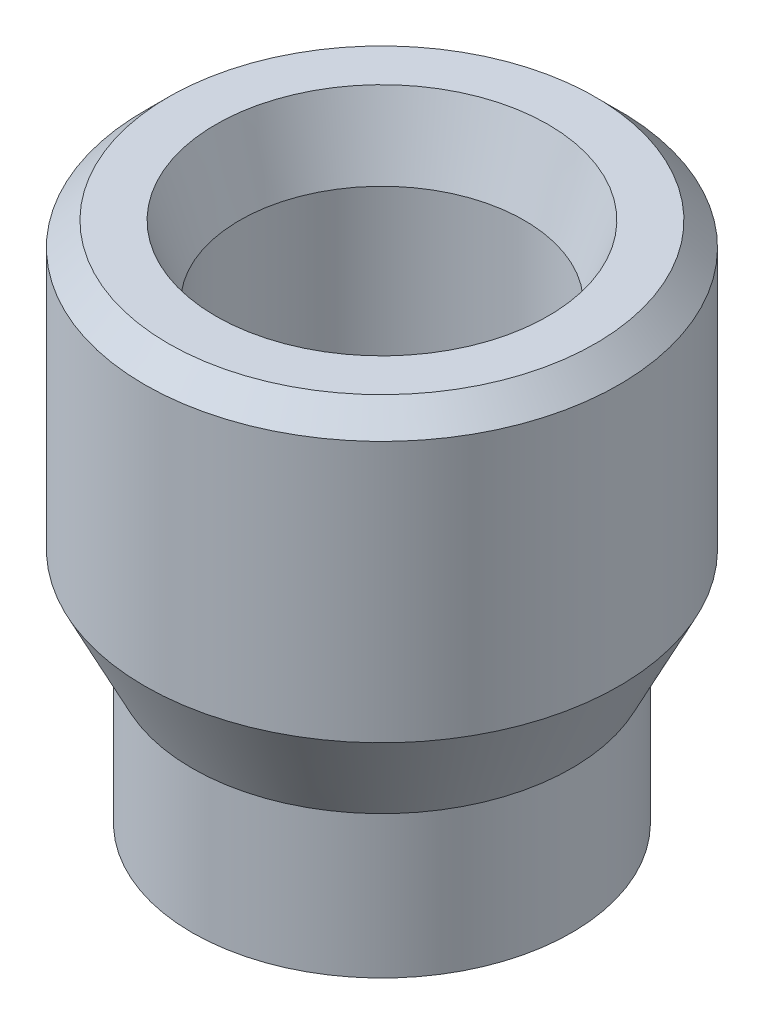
ISO-10303-21;
HEADER;
FILE_DESCRIPTION(('STEP AP214'),'2;1');
FILE_NAME('part.step','',(''),(''),'','','');
FILE_SCHEMA(('AUTOMOTIVE_DESIGN { 1 0 10303 214 1 1 1 1 }'));
ENDSEC;
DATA;
#1=APPLICATION_CONTEXT('core data for automotive mechanical design processes');
#2=APPLICATION_PROTOCOL_DEFINITION('international standard','automotive_design',2000,#1);
#3=PRODUCT_CONTEXT('',#1,'mechanical');
#4=PRODUCT('Part','Part','',(#3));
#5=PRODUCT_RELATED_PRODUCT_CATEGORY('part','',(#4));
#6=PRODUCT_DEFINITION_FORMATION('','',#4);
#7=PRODUCT_DEFINITION_CONTEXT('part definition',#1,'design');
#8=PRODUCT_DEFINITION('design','',#6,#7);
#9=PRODUCT_DEFINITION_SHAPE('','',#8);
#10=(LENGTH_UNIT() NAMED_UNIT(*) SI_UNIT(.MILLI.,.METRE.));
#11=(NAMED_UNIT(*) PLANE_ANGLE_UNIT() SI_UNIT($,.RADIAN.));
#12=(NAMED_UNIT(*) SI_UNIT($,.STERADIAN.) SOLID_ANGLE_UNIT());
#13=UNCERTAINTY_MEASURE_WITH_UNIT(LENGTH_MEASURE(1.E-05),#10,'distance_accuracy_value','');
#14=(GEOMETRIC_REPRESENTATION_CONTEXT(3) GLOBAL_UNCERTAINTY_ASSIGNED_CONTEXT((#13)) GLOBAL_UNIT_ASSIGNED_CONTEXT((#10,
#11,#12)) REPRESENTATION_CONTEXT('',''));
#15=CARTESIAN_POINT('',(0.,0.,0.));
#16=DIRECTION('',(0.,0.,1.));
#17=DIRECTION('',(1.,0.,0.));
#18=AXIS2_PLACEMENT_3D('',#15,#16,#17);
#19=CARTESIAN_POINT('',(0.,10.,0.));
#20=DIRECTION('',(0.,-1.,0.));
#21=DIRECTION('',(0.,0.,-1.));
#22=AXIS2_PLACEMENT_3D('',#19,#20,#21);
#23=CYLINDRICAL_SURFACE('',#22,8.);
#24=CARTESIAN_POINT('',(0.,6.00000000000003,0.));
#25=DIRECTION('',(0.,1.,0.));
#26=DIRECTION('',(0.,0.,1.));
#27=AXIS2_PLACEMENT_3D('',#24,#25,#26);
#28=CIRCLE('',#27,8.);
#29=CARTESIAN_POINT('',(0.,6.00000000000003,8.));
#30=VERTEX_POINT('',#29);
#31=EDGE_CURVE('E53',#30,#30,#28,.F.);
#32=ORIENTED_EDGE('',*,*,#31,.T.);
#33=EDGE_LOOP('',(#32));
#34=FACE_BOUND('',#33,.T.);
#35=CARTESIAN_POINT('',(0.,0.,0.));
#36=DIRECTION('',(0.,1.,0.));
#37=DIRECTION('',(0.,0.,1.));
#38=AXIS2_PLACEMENT_3D('',#35,#36,#37);
#39=CIRCLE('',#38,8.);
#40=CARTESIAN_POINT('',(0.,0.,8.));
#41=VERTEX_POINT('',#40);
#42=EDGE_CURVE('E56',#41,#41,#39,.T.);
#43=ORIENTED_EDGE('',*,*,#42,.T.);
#44=EDGE_LOOP('',(#43));
#45=FACE_BOUND('',#44,.T.);
#46=ADVANCED_FACE('F33',(#34,#45),#23,.T.);
#47=CARTESIAN_POINT('',(0.,0.,0.));
#48=DIRECTION('',(0.,1.,0.));
#49=DIRECTION('',(0.,0.,1.));
#50=AXIS2_PLACEMENT_3D('',#47,#48,#49);
#51=PLANE('',#50);
#52=CARTESIAN_POINT('',(0.,0.,0.));
#53=DIRECTION('',(0.,-1.,0.));
#54=DIRECTION('',(0.,0.,-1.));
#55=AXIS2_PLACEMENT_3D('',#52,#53,#54);
#56=CIRCLE('',#55,3.5);
#57=CARTESIAN_POINT('',(0.,0.,-3.5));
#58=VERTEX_POINT('',#57);
#59=EDGE_CURVE('E62',#58,#58,#56,.T.);
#60=ORIENTED_EDGE('',*,*,#59,.F.);
#61=EDGE_LOOP('',(#60));
#62=FACE_BOUND('',#61,.T.);
#63=ORIENTED_EDGE('',*,*,#42,.F.);
#64=EDGE_LOOP('',(#63));
#65=FACE_BOUND('',#64,.T.);
#66=ADVANCED_FACE('F87',(#62,#65),#51,.F.);
#67=CARTESIAN_POINT('',(0.,22.,0.));
#68=DIRECTION('',(0.,-1.,0.));
#69=DIRECTION('',(0.,0.,-1.));
#70=AXIS2_PLACEMENT_3D('',#67,#68,#69);
#71=CYLINDRICAL_SURFACE('',#70,10.);
#72=CARTESIAN_POINT('',(0.,21.,0.));
#73=DIRECTION('',(0.,1.,0.));
#74=DIRECTION('',(0.,0.,1.));
#75=AXIS2_PLACEMENT_3D('',#72,#73,#74);
#76=CIRCLE('',#75,10.);
#77=CARTESIAN_POINT('',(0.,21.,10.));
#78=VERTEX_POINT('',#77);
#79=EDGE_CURVE('E44',#78,#78,#76,.F.);
#80=ORIENTED_EDGE('',*,*,#79,.T.);
#81=EDGE_LOOP('',(#80));
#82=FACE_BOUND('',#81,.T.);
#83=CARTESIAN_POINT('',(0.,10.,0.));
#84=DIRECTION('',(0.,1.,0.));
#85=DIRECTION('',(0.,0.,1.));
#86=AXIS2_PLACEMENT_3D('',#83,#84,#85);
#87=CIRCLE('',#86,10.);
#88=CARTESIAN_POINT('',(0.,10.,10.));
#89=VERTEX_POINT('',#88);
#90=EDGE_CURVE('E59',#89,#89,#87,.T.);
#91=ORIENTED_EDGE('',*,*,#90,.T.);
#92=EDGE_LOOP('',(#91));
#93=FACE_BOUND('',#92,.T.);
#94=ADVANCED_FACE('F93',(#82,#93),#71,.T.);
#95=CARTESIAN_POINT('',(0.,22.,0.));
#96=DIRECTION('',(0.,1.,0.));
#97=DIRECTION('',(0.,0.,1.));
#98=AXIS2_PLACEMENT_3D('',#95,#96,#97);
#99=PLANE('',#98);
#100=CARTESIAN_POINT('',(0.,22.,0.));
#101=DIRECTION('',(0.,1.,0.));
#102=DIRECTION('',(0.,0.,1.));
#103=AXIS2_PLACEMENT_3D('',#100,#101,#102);
#104=CIRCLE('',#103,7.00000000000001);
#105=CARTESIAN_POINT('',(0.,22.,7.00000000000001));
#106=VERTEX_POINT('',#105);
#107=EDGE_CURVE('E10',#106,#106,#104,.F.);
#108=ORIENTED_EDGE('',*,*,#107,.T.);
#109=EDGE_LOOP('',(#108));
#110=FACE_BOUND('',#109,.T.);
#111=CARTESIAN_POINT('',(0.,22.,0.));
#112=DIRECTION('',(0.,1.,0.));
#113=DIRECTION('',(0.,0.,1.));
#114=AXIS2_PLACEMENT_3D('',#111,#112,#113);
#115=CIRCLE('',#114,8.99999999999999);
#116=CARTESIAN_POINT('',(0.,22.,8.99999999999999));
#117=VERTEX_POINT('',#116);
#118=EDGE_CURVE('E48',#117,#117,#115,.T.);
#119=ORIENTED_EDGE('',*,*,#118,.T.);
#120=EDGE_LOOP('',(#119));
#121=FACE_BOUND('',#120,.T.);
#122=ADVANCED_FACE('F102',(#110,#121),#99,.T.);
#123=CARTESIAN_POINT('',(0.,10.,0.));
#124=DIRECTION('',(0.,1.,0.));
#125=DIRECTION('',(0.,0.,1.));
#126=AXIS2_PLACEMENT_3D('',#123,#124,#125);
#127=CONICAL_SURFACE('',#126,9.99999999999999,0.463647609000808);
#128=ORIENTED_EDGE('',*,*,#31,.F.);
#129=EDGE_LOOP('',(#128));
#130=FACE_BOUND('',#129,.T.);
#131=ORIENTED_EDGE('',*,*,#90,.F.);
#132=EDGE_LOOP('',(#131));
#133=FACE_BOUND('',#132,.T.);
#134=ADVANCED_FACE('F99',(#130,#133),#127,.T.);
#135=CARTESIAN_POINT('',(0.,22.,0.));
#136=DIRECTION('',(0.,-1.,0.));
#137=DIRECTION('',(0.,0.,-1.));
#138=AXIS2_PLACEMENT_3D('',#135,#136,#137);
#139=CONICAL_SURFACE('',#138,8.99999999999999,0.785398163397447);
#140=ORIENTED_EDGE('',*,*,#79,.F.);
#141=EDGE_LOOP('',(#140));
#142=FACE_BOUND('',#141,.T.);
#143=ORIENTED_EDGE('',*,*,#118,.F.);
#144=EDGE_LOOP('',(#143));
#145=FACE_BOUND('',#144,.T.);
#146=ADVANCED_FACE('F101',(#142,#145),#139,.T.);
#147=CARTESIAN_POINT('',(0.,11.,0.));
#148=DIRECTION('',(0.,-1.,0.));
#149=DIRECTION('',(0.,0.,-1.));
#150=AXIS2_PLACEMENT_3D('',#147,#148,#149);
#151=CYLINDRICAL_SURFACE('',#150,3.5);
#152=CARTESIAN_POINT('',(0.,11.,0.));
#153=DIRECTION('',(0.,1.,0.));
#154=DIRECTION('',(0.,0.,1.));
#155=AXIS2_PLACEMENT_3D('',#152,#153,#154);
#156=CIRCLE('',#155,3.5);
#157=CARTESIAN_POINT('',(0.,11.,3.5));
#158=VERTEX_POINT('',#157);
#159=EDGE_CURVE('E65',#158,#158,#156,.F.);
#160=ORIENTED_EDGE('',*,*,#159,.F.);
#161=EDGE_LOOP('',(#160));
#162=FACE_BOUND('',#161,.T.);
#163=ORIENTED_EDGE('',*,*,#59,.T.);
#164=EDGE_LOOP('',(#163));
#165=FACE_BOUND('',#164,.T.);
#166=ADVANCED_FACE('F83',(#162,#165),#151,.F.);
#167=CARTESIAN_POINT('',(0.,11.,0.));
#168=DIRECTION('',(0.,1.,0.));
#169=DIRECTION('',(0.,0.,1.));
#170=AXIS2_PLACEMENT_3D('',#167,#168,#169);
#171=PLANE('',#170);
#172=CARTESIAN_POINT('',(0.,11.,0.));
#173=DIRECTION('',(0.,1.,0.));
#174=DIRECTION('',(0.,0.,1.));
#175=AXIS2_PLACEMENT_3D('',#172,#173,#174);
#176=CIRCLE('',#175,6.);
#177=CARTESIAN_POINT('',(0.,11.,6.));
#178=VERTEX_POINT('',#177);
#179=EDGE_CURVE('E68',#178,#178,#176,.T.);
#180=ORIENTED_EDGE('',*,*,#179,.T.);
#181=EDGE_LOOP('',(#180));
#182=FACE_BOUND('',#181,.T.);
#183=ORIENTED_EDGE('',*,*,#159,.T.);
#184=EDGE_LOOP('',(#183));
#185=FACE_BOUND('',#184,.T.);
#186=ADVANCED_FACE('F72',(#182,#185),#171,.T.);
#187=CARTESIAN_POINT('',(0.,11.,0.));
#188=DIRECTION('',(0.,1.,0.));
#189=DIRECTION('',(0.,0.,1.));
#190=AXIS2_PLACEMENT_3D('',#187,#188,#189);
#191=CYLINDRICAL_SURFACE('',#190,6.);
#192=CARTESIAN_POINT('',(0.,18.9999999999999,0.));
#193=DIRECTION('',(0.,1.,0.));
#194=DIRECTION('',(0.,0.,1.));
#195=AXIS2_PLACEMENT_3D('',#192,#193,#194);
#196=CIRCLE('',#195,6.);
#197=CARTESIAN_POINT('',(0.,18.9999999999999,6.));
#198=VERTEX_POINT('',#197);
#199=EDGE_CURVE('E40',#198,#198,#196,.T.);
#200=ORIENTED_EDGE('',*,*,#199,.T.);
#201=EDGE_LOOP('',(#200));
#202=FACE_BOUND('',#201,.T.);
#203=ORIENTED_EDGE('',*,*,#179,.F.);
#204=EDGE_LOOP('',(#203));
#205=FACE_BOUND('',#204,.T.);
#206=ADVANCED_FACE('F75',(#202,#205),#191,.F.);
#207=CARTESIAN_POINT('',(0.,18.9999999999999,0.));
#208=DIRECTION('',(0.,1.,0.));
#209=DIRECTION('',(0.,0.,1.));
#210=AXIS2_PLACEMENT_3D('',#207,#208,#209);
#211=CONICAL_SURFACE('',#210,6.,0.32175055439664);
#212=CARTESIAN_POINT('',(0.,22.,7.00000000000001));
#213=CARTESIAN_POINT('',(0.,21.96875,6.98958333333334));
#214=CARTESIAN_POINT('',(0.,21.9375,6.97916666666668));
#215=CARTESIAN_POINT('',(0.,21.875,6.95833333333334));
#216=CARTESIAN_POINT('',(0.,21.84375,6.94791666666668));
#217=CARTESIAN_POINT('',(0.,21.78125,6.92708333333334));
#218=CARTESIAN_POINT('',(0.,21.75,6.91666666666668));
#219=CARTESIAN_POINT('',(0.,21.6875,6.89583333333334));
#220=CARTESIAN_POINT('',(0.,21.65625,6.88541666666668));
#221=CARTESIAN_POINT('',(0.,21.59375,6.86458333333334));
#222=CARTESIAN_POINT('',(0.,21.5625,6.85416666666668));
#223=CARTESIAN_POINT('',(0.,21.5,6.83333333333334));
#224=CARTESIAN_POINT('',(0.,21.46875,6.82291666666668));
#225=CARTESIAN_POINT('',(0.,21.40625,6.80208333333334));
#226=CARTESIAN_POINT('',(0.,21.375,6.79166666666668));
#227=CARTESIAN_POINT('',(0.,21.3125,6.77083333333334));
#228=CARTESIAN_POINT('',(0.,21.28125,6.76041666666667));
#229=CARTESIAN_POINT('',(0.,21.21875,6.73958333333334));
#230=CARTESIAN_POINT('',(0.,21.1875,6.72916666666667));
#231=CARTESIAN_POINT('',(0.,21.125,6.70833333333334));
#232=CARTESIAN_POINT('',(0.,21.09375,6.69791666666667));
#233=CARTESIAN_POINT('',(0.,21.03125,6.67708333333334));
#234=CARTESIAN_POINT('',(0.,21.,6.66666666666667));
#235=CARTESIAN_POINT('',(0.,20.9375,6.64583333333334));
#236=CARTESIAN_POINT('',(0.,20.90625,6.63541666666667));
#237=CARTESIAN_POINT('',(0.,20.84375,6.61458333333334));
#238=CARTESIAN_POINT('',(0.,20.8125,6.60416666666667));
#239=CARTESIAN_POINT('',(0.,20.75,6.58333333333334));
#240=CARTESIAN_POINT('',(0.,20.71875,6.57291666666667));
#241=CARTESIAN_POINT('',(0.,20.65625,6.55208333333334));
#242=CARTESIAN_POINT('',(0.,20.625,6.54166666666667));
#243=CARTESIAN_POINT('',(0.,20.5625,6.52083333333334));
#244=CARTESIAN_POINT('',(0.,20.53125,6.51041666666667));
#245=CARTESIAN_POINT('',(0.,20.46875,6.48958333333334));
#246=CARTESIAN_POINT('',(0.,20.4375,6.47916666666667));
#247=CARTESIAN_POINT('',(0.,20.375,6.45833333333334));
#248=CARTESIAN_POINT('',(0.,20.34375,6.44791666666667));
#249=CARTESIAN_POINT('',(0.,20.28125,6.42708333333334));
#250=CARTESIAN_POINT('',(0.,20.25,6.41666666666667));
#251=CARTESIAN_POINT('',(0.,20.1875,6.39583333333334));
#252=CARTESIAN_POINT('',(0.,20.15625,6.38541666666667));
#253=CARTESIAN_POINT('',(0.,20.09375,6.36458333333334));
#254=CARTESIAN_POINT('',(0.,20.0625,6.35416666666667));
#255=CARTESIAN_POINT('',(0.,20.,6.33333333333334));
#256=CARTESIAN_POINT('',(0.,19.96875,6.32291666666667));
#257=CARTESIAN_POINT('',(0.,19.90625,6.30208333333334));
#258=CARTESIAN_POINT('',(0.,19.875,6.29166666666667));
#259=CARTESIAN_POINT('',(0.,19.8125,6.27083333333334));
#260=CARTESIAN_POINT('',(0.,19.78125,6.26041666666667));
#261=CARTESIAN_POINT('',(0.,19.71875,6.23958333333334));
#262=CARTESIAN_POINT('',(0.,19.6875,6.22916666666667));
#263=CARTESIAN_POINT('',(0.,19.625,6.20833333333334));
#264=CARTESIAN_POINT('',(0.,19.59375,6.19791666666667));
#265=CARTESIAN_POINT('',(0.,19.53125,6.17708333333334));
#266=CARTESIAN_POINT('',(0.,19.5,6.16666666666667));
#267=CARTESIAN_POINT('',(0.,19.4375,6.14583333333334));
#268=CARTESIAN_POINT('',(0.,19.4062499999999,6.13541666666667));
#269=CARTESIAN_POINT('',(0.,19.3437499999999,6.11458333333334));
#270=CARTESIAN_POINT('',(0.,19.3124999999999,6.10416666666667));
#271=CARTESIAN_POINT('',(0.,19.2499999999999,6.08333333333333));
#272=CARTESIAN_POINT('',(0.,19.2187499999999,6.07291666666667));
#273=CARTESIAN_POINT('',(0.,19.1562499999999,6.05208333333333));
#274=CARTESIAN_POINT('',(0.,19.1249999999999,6.04166666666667));
#275=CARTESIAN_POINT('',(0.,19.0624999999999,6.02083333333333));
#276=CARTESIAN_POINT('',(0.,19.0312499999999,6.01041666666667));
#277=CARTESIAN_POINT('',(0.,18.9999999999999,6.));
#278=B_SPLINE_CURVE_WITH_KNOTS('',3,(#212,#213,#214,#215,#216,#217,#218,#219,#220,#221,#222,
#223,#224,#225,#226,#227,#228,#229,#230,#231,#232,#233,#234,#235,#236,#237,#238,#239,#240,#241,
#242,#243,#244,#245,#246,#247,#248,#249,#250,#251,#252,#253,#254,#255,#256,#257,#258,#259,#260,
#261,#262,#263,#264,#265,#266,#267,#268,#269,#270,#271,#272,#273,#274,#275,#276,#277),
.UNSPECIFIED.,.F.,.F.,(4,2,2,2,2,2,2,2,2,2,2,2,2,2,2,2,2,2,2,2,2,2,2,2,2,2,2,2,2,2,2,2,4),(0.,
0.0988211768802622,0.197642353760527,0.29646353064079,0.395284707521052,0.494105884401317,
0.592927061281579,0.691748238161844,0.790569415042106,0.889390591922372,0.988211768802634,
1.0870329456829,1.18585412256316,1.28467529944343,1.38349647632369,1.48231765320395,
1.58113883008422,1.67996000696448,1.77878118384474,1.87760236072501,1.97642353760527,
2.07524471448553,2.1740658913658,2.27288706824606,2.37170824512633,2.47052942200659,
2.56935059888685,2.66817177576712,2.76699295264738,2.86581412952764,2.96463530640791,
3.06345648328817,3.16227766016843),.UNSPECIFIED.);
#279=EDGE_CURVE('BSEAM35',#106,#198,#278,.T.);
#280=ORIENTED_EDGE('',*,*,#107,.F.);
#281=ORIENTED_EDGE('',*,*,#199,.F.);
#282=ORIENTED_EDGE('',*,*,#279,.T.);
#283=ORIENTED_EDGE('',*,*,#279,.F.);
#284=EDGE_LOOP('',(#280,#282,#281,#283));
#285=FACE_BOUND('',#284,.T.);
#286=ADVANCED_FACE('F35',(#285),#211,.F.);
#287=CLOSED_SHELL('',(#46,#66,#94,#122,#134,#146,#166,#186,#206,#286));
#288=MANIFOLD_SOLID_BREP('B2',#287);
#289=ADVANCED_BREP_SHAPE_REPRESENTATION('',(#18,#288),#14);
#290=SHAPE_DEFINITION_REPRESENTATION(#9,#289);
ENDSEC;
END-ISO-10303-21;
